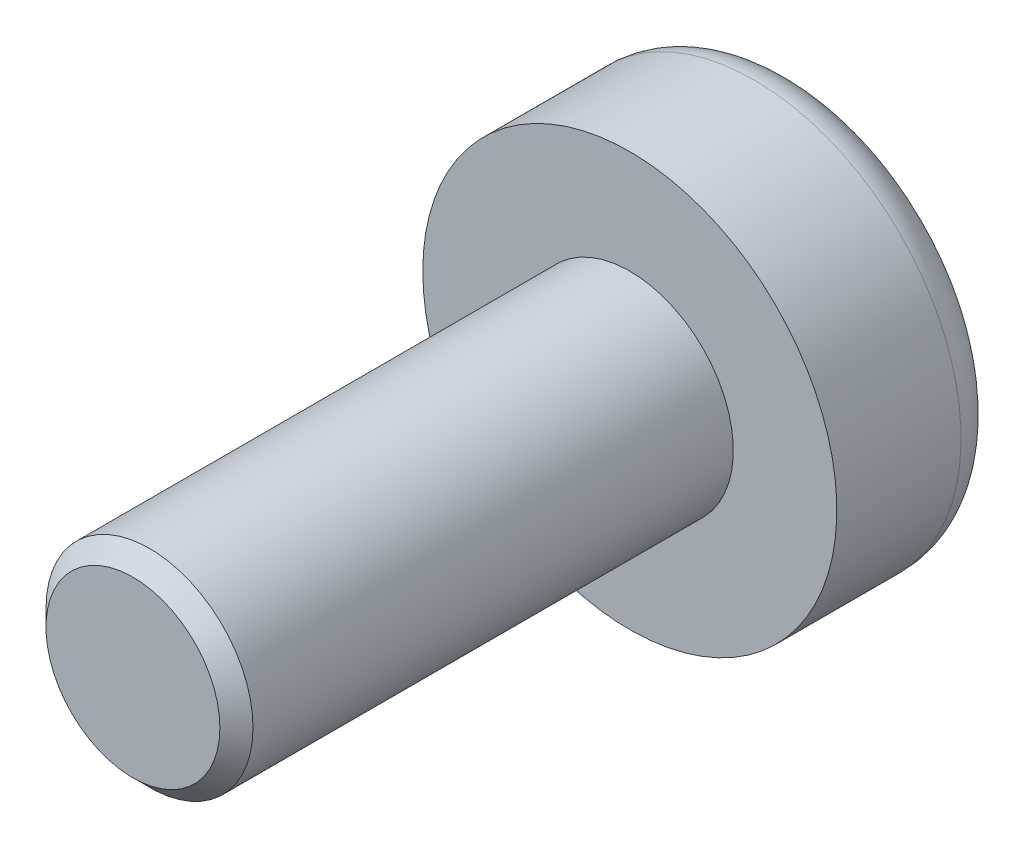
from build123d import *

# Parameters (mm, degrees)
ESQUISSE1_R             = 1.25
EXTRUSION1_DEPTH        = 6
CHANFREIN1_SIZE         = 0.2
ESQUISSE2_R             = 2.5
EXTRUSION2_DEPTH        = 2
CONG_1_R                = 0.5
ENL_V_MAT_EXTRU_1_DEPTH = 0.5


with BuildPart() as part:
    # Esquisse1 → Extrusion1 (new body)
    with BuildSketch(Plane.XY):
        Circle(ESQUISSE1_R)
    extrude(amount=EXTRUSION1_DEPTH)

    # Chanfrein1
    chanfrein1_edges = [part.edges().sort_by_distance(p)[0] for p in [
        (-1.25, 0, 6),
    ]]
    chamfer(chanfrein1_edges, length=CHANFREIN1_SIZE)

    # Esquisse2 → Extrusion2 (add)
    with BuildSketch(Plane(origin=(0, 0, 0), x_dir=(-1, 0, 0), z_dir=(0, 0, -1))):
        Circle(ESQUISSE2_R)
    extrude(amount=EXTRUSION2_DEPTH)

    # Cong_1
    cong_1_edges = [part.edges().sort_by_distance(p)[0] for p in [
        (2.5, 0, -2),
    ]]
    fillet(cong_1_edges, radius=CONG_1_R)

    # Esquisse3 → Enl_v. mat.-Extru.1 (cut)
    with BuildSketch(Plane(origin=(0, 0, -2), x_dir=(-1, 0, 0), z_dir=(0, 0, -1))):
        Polygon((-1.171442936, 0.206133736), (-0.206133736, 0.206133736), (-0.206133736, 1.040723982), (0.206133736, 1.040723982), (0.206133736, 0.206133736), (1.121166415, 0.206133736), (1.121166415, -0.21618904), (0.206133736, -0.21618904), (0.206133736, -1.131221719), (-0.206133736, -1.131221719), (-0.206133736, -0.21618904), (-1.171442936, -0.21618904), align=None)
    extrude(amount=-ENL_V_MAT_EXTRU_1_DEPTH, mode=Mode.SUBTRACT)


solid = part.part
